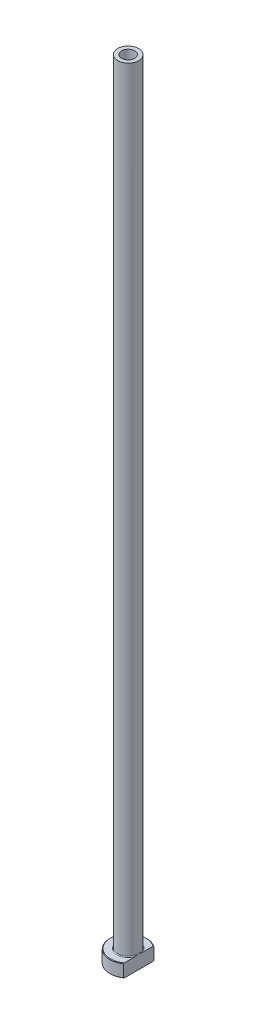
ISO-10303-21;
HEADER;
FILE_DESCRIPTION(('STEP AP214'),'2;1');
FILE_NAME('part.step','',(''),(''),'','','');
FILE_SCHEMA(('AUTOMOTIVE_DESIGN { 1 0 10303 214 1 1 1 1 }'));
ENDSEC;
DATA;
#1=APPLICATION_CONTEXT('core data for automotive mechanical design processes');
#2=APPLICATION_PROTOCOL_DEFINITION('international standard','automotive_design',2000,#1);
#3=PRODUCT_CONTEXT('',#1,'mechanical');
#4=PRODUCT('Part','Part','',(#3));
#5=PRODUCT_RELATED_PRODUCT_CATEGORY('part','',(#4));
#6=PRODUCT_DEFINITION_FORMATION('','',#4);
#7=PRODUCT_DEFINITION_CONTEXT('part definition',#1,'design');
#8=PRODUCT_DEFINITION('design','',#6,#7);
#9=PRODUCT_DEFINITION_SHAPE('','',#8);
#10=(LENGTH_UNIT() NAMED_UNIT(*) SI_UNIT(.MILLI.,.METRE.));
#11=(NAMED_UNIT(*) PLANE_ANGLE_UNIT() SI_UNIT($,.RADIAN.));
#12=(NAMED_UNIT(*) SI_UNIT($,.STERADIAN.) SOLID_ANGLE_UNIT());
#13=UNCERTAINTY_MEASURE_WITH_UNIT(LENGTH_MEASURE(1.E-05),#10,'distance_accuracy_value','');
#14=(GEOMETRIC_REPRESENTATION_CONTEXT(3) GLOBAL_UNCERTAINTY_ASSIGNED_CONTEXT((#13)) GLOBAL_UNIT_ASSIGNED_CONTEXT((#10,
#11,#12)) REPRESENTATION_CONTEXT('',''));
#15=CARTESIAN_POINT('',(0.,0.,0.));
#16=DIRECTION('',(0.,0.,1.));
#17=DIRECTION('',(1.,0.,0.));
#18=AXIS2_PLACEMENT_3D('',#15,#16,#17);
#19=CARTESIAN_POINT('',(0.,92.1876809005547,0.));
#20=DIRECTION('',(0.,1.,0.));
#21=DIRECTION('',(0.,0.,1.));
#22=AXIS2_PLACEMENT_3D('',#19,#20,#21);
#23=CYLINDRICAL_SURFACE('',#22,2.50000000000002);
#24=CARTESIAN_POINT('',(0.,300.,0.));
#25=DIRECTION('',(0.,1.,0.));
#26=DIRECTION('',(0.,0.,1.));
#27=AXIS2_PLACEMENT_3D('',#24,#25,#26);
#28=CIRCLE('',#27,2.50000000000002);
#29=CARTESIAN_POINT('',(0.,300.,2.50000000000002));
#30=VERTEX_POINT('',#29);
#31=EDGE_CURVE('E167',#30,#30,#28,.T.);
#32=ORIENTED_EDGE('',*,*,#31,.T.);
#33=EDGE_LOOP('',(#32));
#34=FACE_BOUND('',#33,.T.);
#35=CARTESIAN_POINT('',(0.,255.,0.));
#36=DIRECTION('',(0.,1.,0.));
#37=DIRECTION('',(0.,0.,1.));
#38=AXIS2_PLACEMENT_3D('',#35,#36,#37);
#39=CIRCLE('',#38,2.50000000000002);
#40=CARTESIAN_POINT('',(0.,255.,2.50000000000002));
#41=VERTEX_POINT('',#40);
#42=EDGE_CURVE('E170',#41,#41,#39,.T.);
#43=ORIENTED_EDGE('',*,*,#42,.F.);
#44=EDGE_LOOP('',(#43));
#45=FACE_BOUND('',#44,.T.);
#46=ADVANCED_FACE('F32',(#34,#45),#23,.F.);
#47=CARTESIAN_POINT('',(-2.50000000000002,300.,0.));
#48=DIRECTION('',(0.,1.,0.));
#49=DIRECTION('',(0.,0.,1.));
#50=AXIS2_PLACEMENT_3D('',#47,#48,#49);
#51=PLANE('',#50);
#52=CARTESIAN_POINT('',(0.,300.,0.));
#53=DIRECTION('',(0.,1.,0.));
#54=DIRECTION('',(0.,0.,1.));
#55=AXIS2_PLACEMENT_3D('',#52,#53,#54);
#56=CIRCLE('',#55,4.00000000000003);
#57=CARTESIAN_POINT('',(0.,300.,4.00000000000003));
#58=VERTEX_POINT('',#57);
#59=EDGE_CURVE('E174',#58,#58,#56,.T.);
#60=ORIENTED_EDGE('',*,*,#59,.T.);
#61=EDGE_LOOP('',(#60));
#62=FACE_BOUND('',#61,.T.);
#63=ORIENTED_EDGE('',*,*,#31,.F.);
#64=EDGE_LOOP('',(#63));
#65=FACE_BOUND('',#64,.T.);
#66=ADVANCED_FACE('F157',(#62,#65),#51,.T.);
#67=CARTESIAN_POINT('',(0.,92.1876809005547,0.));
#68=DIRECTION('',(0.,1.,0.));
#69=DIRECTION('',(0.,0.,1.));
#70=AXIS2_PLACEMENT_3D('',#67,#68,#69);
#71=CYLINDRICAL_SURFACE('',#70,4.00000000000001);
#72=CARTESIAN_POINT('',(0.,5.3,0.));
#73=DIRECTION('',(0.,1.,0.));
#74=DIRECTION('',(0.,0.,1.));
#75=AXIS2_PLACEMENT_3D('',#72,#73,#74);
#76=CIRCLE('',#75,4.00000000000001);
#77=CARTESIAN_POINT('',(4.,5.3,0.));
#78=VERTEX_POINT('',#77);
#79=EDGE_CURVE('E180',#78,#78,#76,.T.);
#80=ORIENTED_EDGE('',*,*,#79,.T.);
#81=EDGE_LOOP('',(#80));
#82=FACE_BOUND('',#81,.T.);
#83=ORIENTED_EDGE('',*,*,#59,.F.);
#84=EDGE_LOOP('',(#83));
#85=FACE_BOUND('',#84,.T.);
#86=ADVANCED_FACE('F162',(#82,#85),#71,.T.);
#87=CARTESIAN_POINT('',(-3.99999999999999,5.,0.));
#88=DIRECTION('',(0.,1.,0.));
#89=DIRECTION('',(0.,0.,1.));
#90=AXIS2_PLACEMENT_3D('',#87,#88,#89);
#91=PLANE('',#90);
#92=DIRECTION('',(0.,0.,1.));
#93=VECTOR('',#92,1.);
#94=CARTESIAN_POINT('',(4.,5.,0.));
#95=LINE('',#94,#93);
#96=CARTESIAN_POINT('',(4.,5.,-5.49909083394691));
#97=VERTEX_POINT('',#96);
#98=CARTESIAN_POINT('',(4.,5.,-1.57797338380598));
#99=VERTEX_POINT('',#98);
#100=EDGE_CURVE('E54',#97,#99,#95,.T.);
#101=ORIENTED_EDGE('',*,*,#100,.F.);
#102=CARTESIAN_POINT('',(0.,5.,0.));
#103=DIRECTION('',(0.,1.,0.));
#104=DIRECTION('',(0.,0.,1.));
#105=AXIS2_PLACEMENT_3D('',#102,#103,#104);
#106=CIRCLE('',#105,6.79999999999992);
#107=CARTESIAN_POINT('',(3.99999999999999,5.,5.49909083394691));
#108=VERTEX_POINT('',#107);
#109=EDGE_CURVE('E186',#97,#108,#106,.T.);
#110=ORIENTED_EDGE('',*,*,#109,.T.);
#111=CARTESIAN_POINT('',(4.,5.,1.57797338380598));
#112=VERTEX_POINT('',#111);
#113=EDGE_CURVE('E134',#112,#108,#95,.T.);
#114=ORIENTED_EDGE('',*,*,#113,.F.);
#115=CARTESIAN_POINT('',(0.,5.,0.));
#116=DIRECTION('',(0.,1.,0.));
#117=DIRECTION('',(0.,0.,1.));
#118=AXIS2_PLACEMENT_3D('',#115,#116,#117);
#119=CIRCLE('',#118,4.30000000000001);
#120=EDGE_CURVE('E183',#112,#99,#119,.F.);
#121=ORIENTED_EDGE('',*,*,#120,.T.);
#122=EDGE_LOOP('',(#101,#110,#114,#121));
#123=FACE_BOUND('',#122,.T.);
#124=ADVANCED_FACE('F197',(#123),#91,.T.);
#125=CARTESIAN_POINT('',(0.,92.1876809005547,0.));
#126=DIRECTION('',(0.,1.,0.));
#127=DIRECTION('',(0.,0.,1.));
#128=AXIS2_PLACEMENT_3D('',#125,#126,#127);
#129=CYLINDRICAL_SURFACE('',#128,6.99999999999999);
#130=DIRECTION('',(0.,-1.,0.));
#131=VECTOR('',#130,1.);
#132=CARTESIAN_POINT('',(3.99999999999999,300.,5.74456264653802));
#133=LINE('',#132,#131);
#134=CARTESIAN_POINT('',(3.99999999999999,4.79999999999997,5.74456264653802));
#135=VERTEX_POINT('',#134);
#136=CARTESIAN_POINT('',(3.99999999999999,0.20000000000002,5.74456264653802));
#137=VERTEX_POINT('',#136);
#138=EDGE_CURVE('E82',#135,#137,#133,.T.);
#139=ORIENTED_EDGE('',*,*,#138,.F.);
#140=CARTESIAN_POINT('',(0.,4.79999999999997,0.));
#141=DIRECTION('',(0.,1.,0.));
#142=DIRECTION('',(0.,0.,1.));
#143=AXIS2_PLACEMENT_3D('',#140,#141,#142);
#144=CIRCLE('',#143,6.99999999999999);
#145=CARTESIAN_POINT('',(4.,4.79999999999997,-5.74456264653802));
#146=VERTEX_POINT('',#145);
#147=EDGE_CURVE('E95',#135,#146,#144,.F.);
#148=ORIENTED_EDGE('',*,*,#147,.T.);
#149=DIRECTION('',(0.,-1.,0.));
#150=VECTOR('',#149,1.);
#151=CARTESIAN_POINT('',(4.,300.,-5.74456264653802));
#152=LINE('',#151,#150);
#153=CARTESIAN_POINT('',(4.,0.20000000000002,-5.74456264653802));
#154=VERTEX_POINT('',#153);
#155=EDGE_CURVE('E192',#146,#154,#152,.T.);
#156=ORIENTED_EDGE('',*,*,#155,.T.);
#157=CARTESIAN_POINT('',(0.,0.20000000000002,0.));
#158=DIRECTION('',(0.,-1.,0.));
#159=DIRECTION('',(0.,0.,-1.));
#160=AXIS2_PLACEMENT_3D('',#157,#158,#159);
#161=CIRCLE('',#160,6.99999999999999);
#162=EDGE_CURVE('E98',#154,#137,#161,.F.);
#163=ORIENTED_EDGE('',*,*,#162,.T.);
#164=EDGE_LOOP('',(#139,#148,#156,#163));
#165=FACE_BOUND('',#164,.T.);
#166=ADVANCED_FACE('F190',(#165),#129,.T.);
#167=CARTESIAN_POINT('',(-6.99999999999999,0.,0.));
#168=DIRECTION('',(0.,-1.,0.));
#169=DIRECTION('',(0.,0.,-1.));
#170=AXIS2_PLACEMENT_3D('',#167,#168,#169);
#171=PLANE('',#170);
#172=CARTESIAN_POINT('',(0.,0.,0.));
#173=DIRECTION('',(0.,-1.,0.));
#174=DIRECTION('',(0.,0.,-1.));
#175=AXIS2_PLACEMENT_3D('',#172,#173,#174);
#176=CIRCLE('',#175,3.24999999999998);
#177=CARTESIAN_POINT('',(0.,0.,-3.24999999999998));
#178=VERTEX_POINT('',#177);
#179=EDGE_CURVE('E40',#178,#178,#176,.F.);
#180=ORIENTED_EDGE('',*,*,#179,.T.);
#181=EDGE_LOOP('',(#180));
#182=FACE_BOUND('',#181,.T.);
#183=DIRECTION('',(0.,0.,-1.));
#184=VECTOR('',#183,1.);
#185=CARTESIAN_POINT('',(3.99999999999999,0.,5.74456264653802));
#186=LINE('',#185,#184);
#187=CARTESIAN_POINT('',(3.99999999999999,0.,5.49909083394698));
#188=VERTEX_POINT('',#187);
#189=CARTESIAN_POINT('',(4.,0.,-5.49909083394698));
#190=VERTEX_POINT('',#189);
#191=EDGE_CURVE('E47',#188,#190,#186,.T.);
#192=ORIENTED_EDGE('',*,*,#191,.F.);
#193=CARTESIAN_POINT('',(0.,0.,0.));
#194=DIRECTION('',(0.,-1.,0.));
#195=DIRECTION('',(0.,0.,-1.));
#196=AXIS2_PLACEMENT_3D('',#193,#194,#195);
#197=CIRCLE('',#196,6.79999999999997);
#198=EDGE_CURVE('E92',#188,#190,#197,.T.);
#199=ORIENTED_EDGE('',*,*,#198,.T.);
#200=EDGE_LOOP('',(#192,#199));
#201=FACE_BOUND('',#200,.T.);
#202=ADVANCED_FACE('F91',(#182,#201),#171,.T.);
#203=CARTESIAN_POINT('',(0.,92.1876809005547,0.));
#204=DIRECTION('',(0.,1.,0.));
#205=DIRECTION('',(0.,0.,1.));
#206=AXIS2_PLACEMENT_3D('',#203,#204,#205);
#207=CYLINDRICAL_SURFACE('',#206,2.75000000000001);
#208=CARTESIAN_POINT('',(0.,0.499999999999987,0.));
#209=DIRECTION('',(0.,-1.,0.));
#210=DIRECTION('',(0.,0.,-1.));
#211=AXIS2_PLACEMENT_3D('',#208,#209,#210);
#212=CIRCLE('',#211,2.75000000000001);
#213=CARTESIAN_POINT('',(0.,0.499999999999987,-2.75000000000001));
#214=VERTEX_POINT('',#213);
#215=EDGE_CURVE('E11',#214,#214,#212,.T.);
#216=ORIENTED_EDGE('',*,*,#215,.T.);
#217=EDGE_LOOP('',(#216));
#218=FACE_BOUND('',#217,.T.);
#219=CARTESIAN_POINT('',(0.,243.,0.));
#220=DIRECTION('',(0.,1.,0.));
#221=DIRECTION('',(0.,0.,1.));
#222=AXIS2_PLACEMENT_3D('',#219,#220,#221);
#223=CIRCLE('',#222,2.75000000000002);
#224=CARTESIAN_POINT('',(0.,243.,2.75000000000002));
#225=VERTEX_POINT('',#224);
#226=EDGE_CURVE('E172',#225,#225,#223,.T.);
#227=ORIENTED_EDGE('',*,*,#226,.T.);
#228=EDGE_LOOP('',(#227));
#229=FACE_BOUND('',#228,.T.);
#230=ADVANCED_FACE('F215',(#218,#229),#207,.F.);
#231=CARTESIAN_POINT('',(0.,243.,0.));
#232=DIRECTION('',(0.,-1.,0.));
#233=DIRECTION('',(0.,0.,-1.));
#234=AXIS2_PLACEMENT_3D('',#231,#232,#233);
#235=CONICAL_SURFACE('',#234,2.75000000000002,0.0208303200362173);
#236=ORIENTED_EDGE('',*,*,#42,.T.);
#237=EDGE_LOOP('',(#236));
#238=FACE_BOUND('',#237,.T.);
#239=ORIENTED_EDGE('',*,*,#226,.F.);
#240=EDGE_LOOP('',(#239));
#241=FACE_BOUND('',#240,.T.);
#242=ADVANCED_FACE('F111',(#238,#241),#235,.F.);
#243=CARTESIAN_POINT('',(0.,5.3,0.));
#244=DIRECTION('',(0.,1.,0.));
#245=DIRECTION('',(0.,0.,1.));
#246=AXIS2_PLACEMENT_3D('',#243,#244,#245);
#247=TOROIDAL_SURFACE('',#246,4.30000000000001,0.3);
#248=ORIENTED_EDGE('',*,*,#120,.F.);
#249=CARTESIAN_POINT('',(4.,5.3,0.));
#250=CARTESIAN_POINT('',(4.,5.30000062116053,-1.06261146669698E-10));
#251=CARTESIAN_POINT('',(4.,5.30000124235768,2.17726199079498E-07));
#252=CARTESIAN_POINT('',(4.,5.30000240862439,8.36141292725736E-07));
#253=CARTESIAN_POINT('',(4.,5.30000294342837,1.25011714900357E-06));
#254=CARTESIAN_POINT('',(4.,5.30000404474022,2.23959386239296E-06));
#255=CARTESIAN_POINT('',(4.,5.30000459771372,2.83084521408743E-06));
#256=CARTESIAN_POINT('',(4.,5.30000559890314,4.06516670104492E-06));
#257=CARTESIAN_POINT('',(4.,5.30000604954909,4.70640147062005E-06));
#258=CARTESIAN_POINT('',(4.,5.30000769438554,7.15677314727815E-06));
#259=CARTESIAN_POINT('',(4.,5.30000879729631,9.02996112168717E-06));
#260=CARTESIAN_POINT('',(4.,5.30001063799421,1.27664902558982E-05));
#261=CARTESIAN_POINT('',(4.,5.30001139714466,1.46197820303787E-05));
#262=CARTESIAN_POINT('',(4.,5.30001453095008,2.23679246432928E-05));
#263=CARTESIAN_POINT('',(4.,5.3000168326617,2.82968783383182E-05));
#264=CARTESIAN_POINT('',(4.,5.30002027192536,3.95668769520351E-05));
#265=CARTESIAN_POINT('',(4.,5.30002152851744,4.48715497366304E-05));
#266=CARTESIAN_POINT('',(4.,5.30003060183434,8.40118257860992E-05));
#267=CARTESIAN_POINT('',(4.,5.3000373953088,0.000118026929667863));
#268=CARTESIAN_POINT('',(4.,5.30006713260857,0.000252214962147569));
#269=CARTESIAN_POINT('',(4.,5.30009559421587,0.000351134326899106));
#270=CARTESIAN_POINT('',(4.,5.30020622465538,0.000742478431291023));
#271=CARTESIAN_POINT('',(4.,5.30028475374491,0.00103561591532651));
#272=CARTESIAN_POINT('',(4.,5.30059889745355,0.00219920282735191));
#273=CARTESIAN_POINT('',(4.,5.30083905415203,0.00306873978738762));
#274=CARTESIAN_POINT('',(4.,5.30183682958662,0.0066914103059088));
#275=CARTESIAN_POINT('',(4.,5.30258877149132,0.00944568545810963));
#276=CARTESIAN_POINT('',(3.99999999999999,5.31066890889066,0.0390293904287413));
#277=CARTESIAN_POINT('',(4.,5.31802631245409,0.0658531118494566));
#278=CARTESIAN_POINT('',(4.,5.33239676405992,0.118441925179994));
#279=CARTESIAN_POINT('',(4.,5.33941183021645,0.144206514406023));
#280=CARTESIAN_POINT('',(4.,5.35427366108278,0.199017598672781));
#281=CARTESIAN_POINT('',(4.,5.36211313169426,0.228066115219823));
#282=CARTESIAN_POINT('',(4.,5.37776349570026,0.28651184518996));
#283=CARTESIAN_POINT('',(4.,5.38557313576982,0.315909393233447));
#284=CARTESIAN_POINT('',(4.,5.404256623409,0.386994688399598));
#285=CARTESIAN_POINT('',(4.,5.41505237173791,0.428703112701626));
#286=CARTESIAN_POINT('',(4.,5.4359231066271,0.511098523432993));
#287=CARTESIAN_POINT('',(4.,5.44600969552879,0.551782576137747));
#288=CARTESIAN_POINT('',(4.,5.47850986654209,0.686599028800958));
#289=CARTESIAN_POINT('',(4.,5.49978370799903,0.781011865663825));
#290=CARTESIAN_POINT('',(4.,5.53807543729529,0.971847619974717));
#291=CARTESIAN_POINT('',(4.,5.55504273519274,1.06828120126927));
#292=CARTESIAN_POINT('',(4.,5.57582405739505,1.21752725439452));
#293=CARTESIAN_POINT('',(4.,5.58209796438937,1.26999379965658));
#294=CARTESIAN_POINT('',(4.,5.59210686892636,1.37516324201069));
#295=CARTESIAN_POINT('',(4.,5.59584265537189,1.42786606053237));
#296=CARTESIAN_POINT('',(4.,5.60010438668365,1.53310673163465));
#297=CARTESIAN_POINT('',(4.,5.6006487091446,1.58564378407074));
#298=CARTESIAN_POINT('',(4.,5.59767158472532,1.69058605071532));
#299=CARTESIAN_POINT('',(4.,5.59415502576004,1.74299134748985));
#300=CARTESIAN_POINT('',(4.,5.58503062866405,1.81903290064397));
#301=CARTESIAN_POINT('',(4.,5.58157617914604,1.84292934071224));
#302=CARTESIAN_POINT('',(4.,5.57329952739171,1.89051061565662));
#303=CARTESIAN_POINT('',(4.,5.56847619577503,1.91419525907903));
#304=CARTESIAN_POINT('',(4.,5.55726644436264,1.96092888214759));
#305=CARTESIAN_POINT('',(4.,5.55089740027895,1.9839819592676));
#306=CARTESIAN_POINT('',(4.,5.53623434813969,2.02945550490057));
#307=CARTESIAN_POINT('',(4.,5.52794253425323,2.0518766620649));
#308=CARTESIAN_POINT('',(4.,5.50887098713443,2.09590631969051));
#309=CARTESIAN_POINT('',(4.,5.49806837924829,2.11750508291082));
#310=CARTESIAN_POINT('',(4.,5.47333401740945,2.15885583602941));
#311=CARTESIAN_POINT('',(4.,5.45941272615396,2.1786136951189));
#312=CARTESIAN_POINT('',(4.,5.4358822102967,2.20522942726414));
#313=CARTESIAN_POINT('',(4.,5.42781139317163,2.2134404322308));
#314=CARTESIAN_POINT('',(4.,5.41065114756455,2.228751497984));
#315=CARTESIAN_POINT('',(4.,5.40156129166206,2.23585108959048));
#316=CARTESIAN_POINT('',(4.,5.38220524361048,2.24859694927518));
#317=CARTESIAN_POINT('',(4.,5.37192420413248,2.25422119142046));
#318=CARTESIAN_POINT('',(4.,5.35045072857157,2.26331064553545));
#319=CARTESIAN_POINT('',(4.,5.33926122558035,2.26678251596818));
#320=CARTESIAN_POINT('',(4.,5.31952044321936,2.27051268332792));
#321=CARTESIAN_POINT('',(4.,5.31108453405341,2.27139016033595));
#322=CARTESIAN_POINT('',(4.,5.29418624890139,2.27168963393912));
#323=CARTESIAN_POINT('',(4.,5.28572387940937,2.27111196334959));
#324=CARTESIAN_POINT('',(4.,5.26904138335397,2.26855580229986));
#325=CARTESIAN_POINT('',(4.,5.26082066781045,2.26658107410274));
#326=CARTESIAN_POINT('',(4.,5.24478214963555,2.26139496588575));
#327=CARTESIAN_POINT('',(4.,5.23696461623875,2.25818277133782));
#328=CARTESIAN_POINT('',(4.,5.21851235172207,2.24908332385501));
#329=CARTESIAN_POINT('',(4.,5.2081521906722,2.24264095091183));
#330=CARTESIAN_POINT('',(4.,5.18857975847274,2.22819957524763));
#331=CARTESIAN_POINT('',(4.,5.17937061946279,2.22019647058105));
#332=CARTESIAN_POINT('',(4.,5.15665383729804,2.19777756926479));
#333=CARTESIAN_POINT('',(4.,5.14403484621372,2.18246908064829));
#334=CARTESIAN_POINT('',(4.,5.12118369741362,2.15020843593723));
#335=CARTESIAN_POINT('',(4.,5.11095480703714,2.13325407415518));
#336=CARTESIAN_POINT('',(4.,5.09273574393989,2.09892324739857));
#337=CARTESIAN_POINT('',(4.,5.08468212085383,2.08157988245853));
#338=CARTESIAN_POINT('',(4.,5.07005901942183,2.04627072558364));
#339=CARTESIAN_POINT('',(4.,5.06349101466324,2.02830433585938));
#340=CARTESIAN_POINT('',(4.,5.0455548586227,1.97350761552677));
#341=CARTESIAN_POINT('',(4.,5.03608974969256,1.93605770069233));
#342=CARTESIAN_POINT('',(4.,5.01780569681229,1.84529235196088));
#343=CARTESIAN_POINT('',(4.,5.01077018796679,1.79164082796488));
#344=CARTESIAN_POINT('',(4.,5.00182846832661,1.68379947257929));
#345=CARTESIAN_POINT('',(4.,4.99993887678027,1.62960846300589));
#346=CARTESIAN_POINT('',(4.,5.00006129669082,1.5236120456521));
#347=CARTESIAN_POINT('',(4.,5.00190698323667,1.47180551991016));
#348=CARTESIAN_POINT('',(4.,5.00841243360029,1.36835357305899));
#349=CARTESIAN_POINT('',(4.,5.01307376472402,1.316708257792));
#350=CARTESIAN_POINT('',(4.,5.0290548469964,1.17431887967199));
#351=CARTESIAN_POINT('',(4.,5.04274090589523,1.08384207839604));
#352=CARTESIAN_POINT('',(4.,5.0670171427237,0.947757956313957));
#353=CARTESIAN_POINT('',(4.,5.07585573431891,0.90181406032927));
#354=CARTESIAN_POINT('',(4.,5.09458665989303,0.810008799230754));
#355=CARTESIAN_POINT('',(4.,5.10448180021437,0.764148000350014));
#356=CARTESIAN_POINT('',(4.,5.1289243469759,0.655631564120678));
#357=CARTESIAN_POINT('',(4.,5.14383556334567,0.593058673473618));
#358=CARTESIAN_POINT('',(4.,5.17458762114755,0.468885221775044));
#359=CARTESIAN_POINT('',(4.,5.19041623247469,0.407281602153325));
#360=CARTESIAN_POINT('',(4.,5.22090834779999,0.291232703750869));
#361=CARTESIAN_POINT('',(4.,5.23550024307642,0.236768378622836));
#362=CARTESIAN_POINT('',(3.99999999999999,5.26562550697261,0.125604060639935));
#363=CARTESIAN_POINT('',(3.99999999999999,5.28117250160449,0.068907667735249));
#364=CARTESIAN_POINT('',(4.,5.29741226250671,0.00944154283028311));
#365=CARTESIAN_POINT('',(4.,5.29816540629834,0.00668315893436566));
#366=CARTESIAN_POINT('',(4.,5.29916346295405,0.00305954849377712));
#367=CARTESIAN_POINT('',(4.,5.29940273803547,0.00219318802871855));
#368=CARTESIAN_POINT('',(4.,5.29971580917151,0.00103357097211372));
#369=CARTESIAN_POINT('',(4.,5.29979412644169,0.000741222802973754));
#370=CARTESIAN_POINT('',(4.,5.29990450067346,0.000350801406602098));
#371=CARTESIAN_POINT('',(4.,5.29993292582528,0.000252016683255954));
#372=CARTESIAN_POINT('',(4.,5.29996263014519,0.000117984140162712));
#373=CARTESIAN_POINT('',(4.,5.299969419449,8.39881949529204E-05));
#374=CARTESIAN_POINT('',(4.,5.29997848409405,4.48674047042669E-05));
#375=CARTESIAN_POINT('',(4.,5.29997973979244,3.95638224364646E-05));
#376=CARTESIAN_POINT('',(4.,5.29998317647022,2.82960367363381E-05));
#377=CARTESIAN_POINT('',(4.,5.29998547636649,2.23681476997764E-05));
#378=CARTESIAN_POINT('',(4.,5.29998860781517,1.46211013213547E-05));
#379=CARTESIAN_POINT('',(4.,5.29998936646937,1.27678912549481E-05));
#380=CARTESIAN_POINT('',(4.,5.29999120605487,9.03144163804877E-06));
#381=CARTESIAN_POINT('',(4.,5.29999230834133,7.15824173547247E-06));
#382=CARTESIAN_POINT('',(4.,5.29999395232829,4.70775574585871E-06));
#383=CARTESIAN_POINT('',(4.,5.29999440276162,4.06646440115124E-06));
#384=CARTESIAN_POINT('',(4.,5.2999954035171,2.83199139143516E-06));
#385=CARTESIAN_POINT('',(4.,5.299995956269,2.24064386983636E-06));
#386=CARTESIAN_POINT('',(4.,5.29999705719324,1.25094003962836E-06));
#387=CARTESIAN_POINT('',(4.,5.29999759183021,8.36841346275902E-07));
#388=CARTESIAN_POINT('',(4.,5.29999875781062,2.18117879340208E-07));
#389=CARTESIAN_POINT('',(4.,5.299999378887,1.0625422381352E-10));
#390=CARTESIAN_POINT('',(4.,5.3,0.));
#391=B_SPLINE_CURVE_WITH_KNOTS('',3,(#249,#250,#251,#252,#253,#254,#255,#256,#257,#258,#259,
#260,#261,#262,#263,#264,#265,#266,#267,#268,#269,#270,#271,#272,#273,#274,#275,#276,#277,#278,
#279,#280,#281,#282,#283,#284,#285,#286,#287,#288,#289,#290,#291,#292,#293,#294,#295,#296,#297,
#298,#299,#300,#301,#302,#303,#304,#305,#306,#307,#308,#309,#310,#311,#312,#313,#314,#315,#316,
#317,#318,#319,#320,#321,#322,#323,#324,#325,#326,#327,#328,#329,#330,#331,#332,#333,#334,#335,
#336,#337,#338,#339,#340,#341,#342,#343,#344,#345,#346,#347,#348,#349,#350,#351,#352,#353,#354,
#355,#356,#357,#358,#359,#360,#361,#362,#363,#364,#365,#366,#367,#368,#369,#370,#371,#372,#373,
#374,#375,#376,#377,#378,#379,#380,#381,#382,#383,#384,#385,#386,#387,#388,#389,#390),
.UNSPECIFIED.,.T.,.F.,(4,2,2,2,2,2,2,2,2,2,2,2,2,2,2,2,2,2,2,2,2,2,2,2,2,2,2,2,2,2,2,2,2,2,2,2,
2,2,2,2,2,2,2,2,2,2,2,2,2,2,2,2,2,2,2,2,2,2,2,2,2,2,2,2,2,2,2,2,2,2,4),(0.,1.87484270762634E-06,
3.90179765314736E-06,6.31683512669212E-06,8.66651565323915E-06,1.51627509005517E-05,
2.11657875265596E-05,4.02090722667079E-05,5.65429401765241E-05,0.0001606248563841,
0.000469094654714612,0.00137985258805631,0.00408571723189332,0.0126514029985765,
0.0960918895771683,0.176200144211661,0.266463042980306,0.357714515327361,0.48696124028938,
0.612707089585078,0.902988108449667,1.19653589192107,1.35501075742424,1.51343634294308,
1.67094875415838,1.82827177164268,1.90067591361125,1.97313996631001,2.04482437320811,
2.11642737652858,2.18871023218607,2.26075412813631,2.29521947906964,2.32969934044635,
2.36466792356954,2.39952778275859,2.42485422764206,2.45017488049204,2.47542760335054,
2.50069697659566,2.53708899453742,2.57357798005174,2.63276032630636,2.69202310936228,
2.74930315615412,2.80663977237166,2.92223125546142,3.08420752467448,3.24670629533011,
3.40212850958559,3.55763731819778,3.83192962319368,3.97228382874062,4.11302057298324,
4.30598130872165,4.49678885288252,4.6659444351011,4.84230602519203,4.85088453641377,
4.85358051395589,4.85448881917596,4.8547968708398,4.8549008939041,4.8549172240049,
4.85493626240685,4.85494226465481,4.85494875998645,4.85495110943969,4.85495352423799,
4.85495555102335,4.8549574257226),.UNSPECIFIED.);
#392=EDGE_CURVE('E126',#112,#78,#391,.T.);
#393=ORIENTED_EDGE('',*,*,#392,.T.);
#394=ORIENTED_EDGE('',*,*,#79,.F.);
#395=CARTESIAN_POINT('',(4.,5.3,0.));
#396=CARTESIAN_POINT('',(4.,5.29999937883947,1.0626241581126E-10));
#397=CARTESIAN_POINT('',(4.,5.29999875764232,-2.17726197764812E-07));
#398=CARTESIAN_POINT('',(4.,5.2999975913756,-8.36141291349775E-07));
#399=CARTESIAN_POINT('',(4.,5.29999705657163,-1.2501171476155E-06));
#400=CARTESIAN_POINT('',(4.,5.29999595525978,-2.23959386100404E-06));
#401=CARTESIAN_POINT('',(4.,5.29999540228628,-2.83084521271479E-06));
#402=CARTESIAN_POINT('',(4.,5.29999440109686,-4.06516669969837E-06));
#403=CARTESIAN_POINT('',(4.,5.29999395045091,-4.7064014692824E-06));
#404=CARTESIAN_POINT('',(4.,5.29999230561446,-7.15677314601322E-06));
#405=CARTESIAN_POINT('',(4.,5.29999120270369,-9.02996112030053E-06));
#406=CARTESIAN_POINT('',(4.,5.29998936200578,-1.27664902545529E-05));
#407=CARTESIAN_POINT('',(4.,5.29998860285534,-1.46197820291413E-05));
#408=CARTESIAN_POINT('',(4.,5.29998546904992,-2.23679246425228E-05));
#409=CARTESIAN_POINT('',(4.,5.2999831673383,-2.8296878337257E-05));
#410=CARTESIAN_POINT('',(4.,5.29997972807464,-3.95668769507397E-05));
#411=CARTESIAN_POINT('',(4.,5.29997847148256,-4.48715497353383E-05));
#412=CARTESIAN_POINT('',(4.,5.29996939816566,-8.40118257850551E-05));
#413=CARTESIAN_POINT('',(4.,5.2999626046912,-0.000118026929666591));
#414=CARTESIAN_POINT('',(4.,5.29993286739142,-0.000252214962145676));
#415=CARTESIAN_POINT('',(4.,5.29990440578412,-0.000351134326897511));
#416=CARTESIAN_POINT('',(4.,5.29979377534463,-0.000742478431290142));
#417=CARTESIAN_POINT('',(4.,5.29971524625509,-0.00103561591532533));
#418=CARTESIAN_POINT('',(4.,5.29940110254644,-0.00219920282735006));
#419=CARTESIAN_POINT('',(4.,5.29916094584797,-0.00306873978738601));
#420=CARTESIAN_POINT('',(4.,5.29816317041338,-0.00669141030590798));
#421=CARTESIAN_POINT('',(4.,5.29741122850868,-0.00944568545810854));
#422=CARTESIAN_POINT('',(3.99999999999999,5.28933109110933,-0.0390293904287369));
#423=CARTESIAN_POINT('',(4.,5.2819736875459,-0.065853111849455));
#424=CARTESIAN_POINT('',(4.,5.26760323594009,-0.118441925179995));
#425=CARTESIAN_POINT('',(4.,5.26058816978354,-0.144206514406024));
#426=CARTESIAN_POINT('',(4.,5.24572633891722,-0.199017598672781));
#427=CARTESIAN_POINT('',(4.,5.23788686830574,-0.228066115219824));
#428=CARTESIAN_POINT('',(4.,5.22223650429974,-0.28651184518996));
#429=CARTESIAN_POINT('',(4.,5.21442686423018,-0.315909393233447));
#430=CARTESIAN_POINT('',(4.,5.195743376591,-0.386994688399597));
#431=CARTESIAN_POINT('',(4.,5.18494762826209,-0.428703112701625));
#432=CARTESIAN_POINT('',(4.,5.1640768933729,-0.511098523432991));
#433=CARTESIAN_POINT('',(4.,5.1539903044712,-0.551782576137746));
#434=CARTESIAN_POINT('',(4.,5.12149013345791,-0.686599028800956));
#435=CARTESIAN_POINT('',(4.,5.10021629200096,-0.781011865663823));
#436=CARTESIAN_POINT('',(4.,5.06192456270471,-0.971847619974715));
#437=CARTESIAN_POINT('',(4.,5.04495726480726,-1.06828120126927));
#438=CARTESIAN_POINT('',(4.,5.02417594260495,-1.21752725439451));
#439=CARTESIAN_POINT('',(4.,5.01790203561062,-1.26999379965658));
#440=CARTESIAN_POINT('',(4.,5.00789313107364,-1.37516324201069));
#441=CARTESIAN_POINT('',(4.,5.00415734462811,-1.42786606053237));
#442=CARTESIAN_POINT('',(4.,4.99989561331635,-1.53310673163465));
#443=CARTESIAN_POINT('',(4.,4.9993512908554,-1.58564378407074));
#444=CARTESIAN_POINT('',(4.,5.00232841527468,-1.69058605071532));
#445=CARTESIAN_POINT('',(4.,5.00584497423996,-1.74299134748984));
#446=CARTESIAN_POINT('',(4.,5.01496937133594,-1.81903290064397));
#447=CARTESIAN_POINT('',(4.,5.01842382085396,-1.84292934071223));
#448=CARTESIAN_POINT('',(4.,5.02670047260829,-1.89051061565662));
#449=CARTESIAN_POINT('',(4.,5.03152380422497,-1.91419525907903));
#450=CARTESIAN_POINT('',(4.,5.04273355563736,-1.96092888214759));
#451=CARTESIAN_POINT('',(4.,5.04910259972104,-1.9839819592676));
#452=CARTESIAN_POINT('',(4.,5.06376565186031,-2.02945550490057));
#453=CARTESIAN_POINT('',(4.,5.07205746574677,-2.0518766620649));
#454=CARTESIAN_POINT('',(4.,5.09112901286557,-2.0959063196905));
#455=CARTESIAN_POINT('',(4.,5.10193162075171,-2.11750508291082));
#456=CARTESIAN_POINT('',(4.,5.12666598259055,-2.15885583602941));
#457=CARTESIAN_POINT('',(4.,5.14058727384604,-2.17861369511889));
#458=CARTESIAN_POINT('',(4.,5.1641177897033,-2.20522942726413));
#459=CARTESIAN_POINT('',(4.,5.17218860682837,-2.2134404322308));
#460=CARTESIAN_POINT('',(4.,5.18934885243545,-2.22875149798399));
#461=CARTESIAN_POINT('',(4.,5.19843870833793,-2.23585108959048));
#462=CARTESIAN_POINT('',(4.,5.21779475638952,-2.24859694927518));
#463=CARTESIAN_POINT('',(4.,5.22807579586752,-2.25422119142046));
#464=CARTESIAN_POINT('',(4.,5.24954927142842,-2.26331064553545));
#465=CARTESIAN_POINT('',(4.,5.26073877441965,-2.26678251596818));
#466=CARTESIAN_POINT('',(4.,5.28047955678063,-2.27051268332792));
#467=CARTESIAN_POINT('',(4.,5.28891546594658,-2.27139016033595));
#468=CARTESIAN_POINT('',(4.,5.3058137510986,-2.27168963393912));
#469=CARTESIAN_POINT('',(4.,5.31427612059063,-2.27111196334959));
#470=CARTESIAN_POINT('',(4.,5.33095861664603,-2.26855580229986));
#471=CARTESIAN_POINT('',(4.,5.33917933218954,-2.26658107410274));
#472=CARTESIAN_POINT('',(4.,5.35521785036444,-2.26139496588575));
#473=CARTESIAN_POINT('',(4.,5.36303538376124,-2.25818277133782));
#474=CARTESIAN_POINT('',(4.,5.38148764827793,-2.24908332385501));
#475=CARTESIAN_POINT('',(4.,5.3918478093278,-2.24264095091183));
#476=CARTESIAN_POINT('',(4.,5.41142024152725,-2.22819957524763));
#477=CARTESIAN_POINT('',(4.,5.4206293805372,-2.22019647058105));
#478=CARTESIAN_POINT('',(4.,5.44334616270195,-2.19777756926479));
#479=CARTESIAN_POINT('',(4.,5.45596515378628,-2.18246908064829));
#480=CARTESIAN_POINT('',(4.,5.47881630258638,-2.15020843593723));
#481=CARTESIAN_POINT('',(4.,5.48904519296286,-2.13325407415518));
#482=CARTESIAN_POINT('',(4.,5.50726425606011,-2.09892324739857));
#483=CARTESIAN_POINT('',(4.,5.51531787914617,-2.08157988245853));
#484=CARTESIAN_POINT('',(4.,5.52994098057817,-2.04627072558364));
#485=CARTESIAN_POINT('',(4.,5.53650898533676,-2.02830433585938));
#486=CARTESIAN_POINT('',(4.,5.5544451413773,-1.97350761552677));
#487=CARTESIAN_POINT('',(4.,5.56391025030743,-1.93605770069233));
#488=CARTESIAN_POINT('',(4.,5.5821943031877,-1.84529235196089));
#489=CARTESIAN_POINT('',(4.,5.58922981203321,-1.79164082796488));
#490=CARTESIAN_POINT('',(4.,5.59817153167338,-1.68379947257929));
#491=CARTESIAN_POINT('',(4.,5.60006112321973,-1.62960846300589));
#492=CARTESIAN_POINT('',(4.,5.59993870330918,-1.5236120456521));
#493=CARTESIAN_POINT('',(4.,5.59809301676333,-1.47180551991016));
#494=CARTESIAN_POINT('',(4.,5.59158756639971,-1.36835357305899));
#495=CARTESIAN_POINT('',(4.,5.58692623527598,-1.316708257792));
#496=CARTESIAN_POINT('',(4.,5.5709451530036,-1.17431887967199));
#497=CARTESIAN_POINT('',(4.,5.55725909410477,-1.08384207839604));
#498=CARTESIAN_POINT('',(4.,5.53298285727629,-0.947757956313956));
#499=CARTESIAN_POINT('',(4.,5.52414426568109,-0.901814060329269));
#500=CARTESIAN_POINT('',(4.,5.50541334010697,-0.810008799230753));
#501=CARTESIAN_POINT('',(4.,5.49551819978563,-0.764148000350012));
#502=CARTESIAN_POINT('',(4.,5.4710756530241,-0.655631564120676));
#503=CARTESIAN_POINT('',(4.,5.45616443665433,-0.593058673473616));
#504=CARTESIAN_POINT('',(4.,5.42541237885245,-0.468885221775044));
#505=CARTESIAN_POINT('',(4.,5.4095837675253,-0.407281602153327));
#506=CARTESIAN_POINT('',(4.,5.37909165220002,-0.291232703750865));
#507=CARTESIAN_POINT('',(4.,5.36449975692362,-0.236768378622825));
#508=CARTESIAN_POINT('',(3.99999999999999,5.33437449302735,-0.125604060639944));
#509=CARTESIAN_POINT('',(3.99999999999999,5.31882749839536,-0.0689076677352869));
#510=CARTESIAN_POINT('',(4.,5.30258773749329,-0.00944154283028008));
#511=CARTESIAN_POINT('',(4.,5.30183459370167,-0.00668315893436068));
#512=CARTESIAN_POINT('',(4.,5.30083653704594,-0.00305954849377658));
#513=CARTESIAN_POINT('',(4.,5.30059726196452,-0.00219318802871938));
#514=CARTESIAN_POINT('',(4.,5.30028419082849,-0.00103357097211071));
#515=CARTESIAN_POINT('',(4.,5.30020587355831,-0.000741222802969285));
#516=CARTESIAN_POINT('',(4.,5.30009549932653,-0.000350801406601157));
#517=CARTESIAN_POINT('',(4.,5.30006707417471,-0.000252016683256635));
#518=CARTESIAN_POINT('',(4.,5.30003736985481,-0.000117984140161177));
#519=CARTESIAN_POINT('',(4.,5.30003058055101,-8.39881949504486E-05));
#520=CARTESIAN_POINT('',(4.,5.30002151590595,-4.48674047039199E-05));
#521=CARTESIAN_POINT('',(4.,5.30002026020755,-3.95638224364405E-05));
#522=CARTESIAN_POINT('',(4.,5.30001682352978,-2.8296036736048E-05));
#523=CARTESIAN_POINT('',(4.,5.30001452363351,-2.23681476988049E-05));
#524=CARTESIAN_POINT('',(4.,5.30001139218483,-1.46211013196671E-05));
#525=CARTESIAN_POINT('',(4.,5.30001063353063,-1.27678912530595E-05));
#526=CARTESIAN_POINT('',(4.,5.30000879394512,-9.03144163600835E-06));
#527=CARTESIAN_POINT('',(4.,5.30000769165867,-7.15824173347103E-06));
#528=CARTESIAN_POINT('',(4.,5.30000604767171,-4.70775574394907E-06));
#529=CARTESIAN_POINT('',(4.,5.30000559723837,-4.06646439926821E-06));
#530=CARTESIAN_POINT('',(4.,5.3000045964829,-2.83199138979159E-06));
#531=CARTESIAN_POINT('',(4.,5.300004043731,-2.2406438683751E-06));
#532=CARTESIAN_POINT('',(4.,5.30000294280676,-1.25094003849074E-06));
#533=CARTESIAN_POINT('',(4.,5.30000240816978,-8.36841345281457E-07));
#534=CARTESIAN_POINT('',(4.,5.30000124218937,-2.18117878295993E-07));
#535=CARTESIAN_POINT('',(4.,5.300000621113,-1.06253077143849E-10));
#536=CARTESIAN_POINT('',(4.,5.3,0.));
#537=B_SPLINE_CURVE_WITH_KNOTS('',3,(#395,#396,#397,#398,#399,#400,#401,#402,#403,#404,#405,
#406,#407,#408,#409,#410,#411,#412,#413,#414,#415,#416,#417,#418,#419,#420,#421,#422,#423,#424,
#425,#426,#427,#428,#429,#430,#431,#432,#433,#434,#435,#436,#437,#438,#439,#440,#441,#442,#443,
#444,#445,#446,#447,#448,#449,#450,#451,#452,#453,#454,#455,#456,#457,#458,#459,#460,#461,#462,
#463,#464,#465,#466,#467,#468,#469,#470,#471,#472,#473,#474,#475,#476,#477,#478,#479,#480,#481,
#482,#483,#484,#485,#486,#487,#488,#489,#490,#491,#492,#493,#494,#495,#496,#497,#498,#499,#500,
#501,#502,#503,#504,#505,#506,#507,#508,#509,#510,#511,#512,#513,#514,#515,#516,#517,#518,#519,
#520,#521,#522,#523,#524,#525,#526,#527,#528,#529,#530,#531,#532,#533,#534,#535,#536),
.UNSPECIFIED.,.T.,.F.,(4,2,2,2,2,2,2,2,2,2,2,2,2,2,2,2,2,2,2,2,2,2,2,2,2,2,2,2,2,2,2,2,2,2,2,2,
2,2,2,2,2,2,2,2,2,2,2,2,2,2,2,2,2,2,2,2,2,2,2,2,2,2,2,2,2,2,2,2,2,2,4),(0.,1.87484270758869E-06,
3.90179765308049E-06,6.31683512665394E-06,8.66651565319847E-06,1.51627509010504E-05,
2.11657875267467E-05,4.02090722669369E-05,5.65429401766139E-05,0.000160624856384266,
0.000469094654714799,0.00137985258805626,0.00408571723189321,0.0126514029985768,
0.0960918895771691,0.176200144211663,0.266463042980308,0.357714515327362,0.48696124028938,
0.612707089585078,0.902988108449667,1.19653589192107,1.35501075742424,1.51343634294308,
1.67094875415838,1.82827177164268,1.90067591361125,1.97313996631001,2.04482437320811,
2.11642737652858,2.18871023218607,2.26075412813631,2.29521947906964,2.32969934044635,
2.36466792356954,2.39952778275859,2.42485422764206,2.45017488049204,2.47542760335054,
2.50069697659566,2.53708899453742,2.57357798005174,2.63276032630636,2.69202310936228,
2.74930315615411,2.80663977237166,2.92223125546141,3.08420752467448,3.24670629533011,
3.40212850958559,3.55763731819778,3.83192962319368,3.97228382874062,4.11302057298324,
4.30598130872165,4.49678885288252,4.6659444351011,4.84230602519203,4.85088453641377,
4.85358051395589,4.85448881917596,4.8547968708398,4.8549008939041,4.85491722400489,
4.85493626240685,4.85494226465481,4.85494875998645,4.85495110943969,4.85495352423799,
4.85495555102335,4.8549574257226),.UNSPECIFIED.);
#538=EDGE_CURVE('E135',#78,#99,#537,.T.);
#539=ORIENTED_EDGE('',*,*,#538,.T.);
#540=EDGE_LOOP('',(#248,#393,#394,#539));
#541=FACE_BOUND('',#540,.T.);
#542=ADVANCED_FACE('F141',(#541),#247,.F.);
#543=CARTESIAN_POINT('',(0.,5.,0.));
#544=DIRECTION('',(0.,-1.,0.));
#545=DIRECTION('',(0.,0.,-1.));
#546=AXIS2_PLACEMENT_3D('',#543,#544,#545);
#547=CONICAL_SURFACE('',#546,6.79999999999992,0.785398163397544);
#548=CARTESIAN_POINT('',(4.,-1.45712845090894,-12.6392822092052));
#549=CARTESIAN_POINT('',(4.,-1.24364466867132,-12.4153556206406));
#550=CARTESIAN_POINT('',(4.,-1.03042430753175,-12.1911774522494));
#551=CARTESIAN_POINT('',(4.,-0.604617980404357,-11.7422167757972));
#552=CARTESIAN_POINT('',(4.,-0.392032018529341,-11.5174342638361));
#553=CARTESIAN_POINT('',(4.,0.0324624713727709,-11.0670952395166));
#554=CARTESIAN_POINT('',(4.,0.244370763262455,-10.8415385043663));
#555=CARTESIAN_POINT('',(4.,0.667290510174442,-10.3895875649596));
#556=CARTESIAN_POINT('',(4.,0.878301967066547,-10.1631933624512));
#557=CARTESIAN_POINT('',(4.,1.51385375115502,-9.47810122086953));
#558=CARTESIAN_POINT('',(4.,1.93676291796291,-9.017882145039));
#559=CARTESIAN_POINT('',(4.,2.56612335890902,-8.32309905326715));
#560=CARTESIAN_POINT('',(4.,2.77505666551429,-8.09078457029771));
#561=CARTESIAN_POINT('',(4.,3.19080254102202,-7.62426940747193));
#562=CARTESIAN_POINT('',(4.,3.3976151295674,-7.39006874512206));
#563=CARTESIAN_POINT('',(4.,3.87870763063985,-6.83891844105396));
#564=CARTESIAN_POINT('',(4.,4.15190978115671,-6.52102188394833));
#565=CARTESIAN_POINT('',(4.,4.55642425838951,-6.03960901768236));
#566=CARTESIAN_POINT('',(4.,4.6904105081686,-5.8783399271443));
#567=CARTESIAN_POINT('',(4.,4.95616531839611,-5.55398469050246));
#568=CARTESIAN_POINT('',(4.,5.08793391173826,-5.39089857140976));
#569=CARTESIAN_POINT('',(4.,5.34841712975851,-5.06288801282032));
#570=CARTESIAN_POINT('',(4.,5.47713786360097,-4.89796843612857));
#571=CARTESIAN_POINT('',(4.,5.73107494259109,-4.56545535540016));
#572=CARTESIAN_POINT('',(4.,5.85629144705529,-4.39786197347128));
#573=CARTESIAN_POINT('',(4.,6.10211465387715,-4.05948444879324));
#574=CARTESIAN_POINT('',(4.,6.22272435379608,-3.88870249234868));
#575=CARTESIAN_POINT('',(4.,6.45796076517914,-3.54308312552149));
#576=CARTESIAN_POINT('',(4.,6.57258867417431,-3.36824653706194));
#577=CARTESIAN_POINT('',(4.,6.76866603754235,-3.05381396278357));
#578=CARTESIAN_POINT('',(4.,6.85173773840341,-2.91523359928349));
#579=CARTESIAN_POINT('',(4.,7.01174537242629,-2.63451965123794));
#580=CARTESIAN_POINT('',(4.,7.08868042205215,-2.49238555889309));
#581=CARTESIAN_POINT('',(4.,7.23459437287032,-2.20416961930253));
#582=CARTESIAN_POINT('',(4.,7.30357836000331,-2.05809037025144));
#583=CARTESIAN_POINT('',(4.,7.43135520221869,-1.76151732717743));
#584=CARTESIAN_POINT('',(4.,7.4901511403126,-1.61102488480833));
#585=CARTESIAN_POINT('',(4.,7.58249315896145,-1.34142099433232));
#586=CARTESIAN_POINT('',(4.,7.61872660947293,-1.22323501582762));
#587=CARTESIAN_POINT('',(4.,7.68223354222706,-0.984492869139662));
#588=CARTESIAN_POINT('',(4.,7.70951040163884,-0.86393761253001));
#589=CARTESIAN_POINT('',(4.,7.75377914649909,-0.621342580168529));
#590=CARTESIAN_POINT('',(4.,7.77080509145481,-0.499309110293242));
#591=CARTESIAN_POINT('',(4.,7.79378778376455,-0.25419448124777));
#592=CARTESIAN_POINT('',(4.,7.79974523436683,-0.13111338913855));
#593=CARTESIAN_POINT('',(4.,7.8002395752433,0.11551726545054));
#594=CARTESIAN_POINT('',(4.,7.79473514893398,0.239066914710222));
#595=CARTESIAN_POINT('',(4.,7.77255119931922,0.485148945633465));
#596=CARTESIAN_POINT('',(4.,7.75587091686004,0.607681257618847));
#597=CARTESIAN_POINT('',(4.,7.71218353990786,0.851269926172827));
#598=CARTESIAN_POINT('',(4.,7.6851436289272,0.972320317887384));
#599=CARTESIAN_POINT('',(4.,7.62201202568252,1.21200276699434));
#600=CARTESIAN_POINT('',(4.,7.58591962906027,1.33063463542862));
#601=CARTESIAN_POINT('',(4.,7.4598007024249,1.70122439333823));
#602=CARTESIAN_POINT('',(4.,7.35572950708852,1.94843335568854));
#603=CARTESIAN_POINT('',(4.,7.18186715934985,2.31048534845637));
#604=CARTESIAN_POINT('',(4.,7.12087684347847,2.4298356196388));
#605=CARTESIAN_POINT('',(4.,6.99403531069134,2.6659362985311));
#606=CARTESIAN_POINT('',(3.99999999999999,6.92818466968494,2.78268701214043));
#607=CARTESIAN_POINT('',(3.99999999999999,6.79157875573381,3.01550895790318));
#608=CARTESIAN_POINT('',(3.99999999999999,6.72076681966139,3.13154660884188));
#609=CARTESIAN_POINT('',(3.99999999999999,6.57583116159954,3.36153379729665));
#610=CARTESIAN_POINT('',(3.99999999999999,6.50170736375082,3.47548328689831));
#611=CARTESIAN_POINT('',(3.99999999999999,6.35080982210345,3.70145107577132));
#612=CARTESIAN_POINT('',(3.99999999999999,6.27403866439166,3.81347110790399));
#613=CARTESIAN_POINT('',(3.99999999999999,6.11824120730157,4.03592316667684));
#614=CARTESIAN_POINT('',(3.99999999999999,6.03921496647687,4.14635523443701));
#615=CARTESIAN_POINT('',(3.99999999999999,5.81506547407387,4.45397159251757));
#616=CARTESIAN_POINT('',(3.99999999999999,5.66782256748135,4.64961120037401));
#617=CARTESIAN_POINT('',(3.99999999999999,5.36880597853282,5.03740600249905));
#618=CARTESIAN_POINT('',(3.99999999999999,5.2170318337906,5.22956083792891));
#619=CARTESIAN_POINT('',(3.99999999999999,4.9099910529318,5.6111546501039));
#620=CARTESIAN_POINT('',(3.99999999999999,4.75472331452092,5.80059273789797));
#621=CARTESIAN_POINT('',(3.99999999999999,4.4415075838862,6.17724364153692));
#622=CARTESIAN_POINT('',(3.99999999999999,4.28355951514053,6.36445639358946));
#623=CARTESIAN_POINT('',(3.99999999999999,3.96525805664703,6.73740614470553));
#624=CARTESIAN_POINT('',(3.99999999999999,3.80490084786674,6.9231398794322));
#625=CARTESIAN_POINT('',(3.99999999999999,3.48247055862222,7.29311320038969));
#626=CARTESIAN_POINT('',(3.99999999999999,3.32039746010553,7.47735277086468));
#627=CARTESIAN_POINT('',(3.99999999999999,2.8321618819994,8.02814826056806));
#628=CARTESIAN_POINT('',(3.99999999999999,2.50391696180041,8.39285790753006));
#629=CARTESIAN_POINT('',(3.99999999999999,1.87512078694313,9.08414492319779));
#630=CARTESIAN_POINT('',(3.99999999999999,1.57491666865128,9.41103929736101));
#631=CARTESIAN_POINT('',(3.99999999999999,0.972153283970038,10.0626830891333));
#632=CARTESIAN_POINT('',(3.99999999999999,0.669593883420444,10.3874323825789));
#633=CARTESIAN_POINT('',(3.99999999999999,0.0637759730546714,11.0341169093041));
#634=CARTESIAN_POINT('',(3.99999999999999,-0.239476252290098,11.3560580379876));
#635=CARTESIAN_POINT('',(3.99999999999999,-0.84735600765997,11.9985921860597));
#636=CARTESIAN_POINT('',(3.99999999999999,-1.1519834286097,12.3191853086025));
#637=CARTESIAN_POINT('',(3.99999999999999,-1.45712845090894,12.6392822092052));
#638=B_SPLINE_CURVE_WITH_KNOTS('',3,(#548,#549,#550,#551,#552,#553,#554,#555,#556,#557,#558,
#559,#560,#561,#562,#563,#564,#565,#566,#567,#568,#569,#570,#571,#572,#573,#574,#575,#576,#577,
#578,#579,#580,#581,#582,#583,#584,#585,#586,#587,#588,#589,#590,#591,#592,#593,#594,#595,#596,
#597,#598,#599,#600,#601,#602,#603,#604,#605,#606,#607,#608,#609,#610,#611,#612,#613,#614,#615,
#616,#617,#618,#619,#620,#621,#622,#623,#624,#625,#626,#627,#628,#629,#630,#631,#632,#633,#634,
#635,#636,#637),.UNSPECIFIED.,.F.,.F.,(4,2,2,2,2,2,2,2,2,2,2,2,2,2,2,2,2,2,2,2,2,2,2,2,2,2,2,2,
2,2,2,2,2,2,2,2,2,2,2,2,2,2,2,2,4),(0.,0.928152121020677,1.85631024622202,2.78476262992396,
3.71321307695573,5.58823033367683,6.52556078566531,7.46288254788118,8.72028576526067,
9.3492704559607,9.97824580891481,10.6058302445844,11.2333861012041,11.8605264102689,
12.4875406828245,12.9721363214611,13.4568016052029,13.9411551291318,14.4253618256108,
14.7959147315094,15.1663277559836,15.5355031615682,15.9046551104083,16.2751400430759,
16.6456501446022,17.0173437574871,17.3890663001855,18.1913996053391,18.5934522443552,
18.9954573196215,19.4032100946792,19.8109722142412,20.2183467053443,20.625710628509,
21.3601838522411,22.0947322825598,22.8295158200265,23.5643203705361,24.3004480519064,
25.0365834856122,26.508549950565,27.8400191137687,29.171564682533,30.498388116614,
31.8251080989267),.UNSPECIFIED.);
#639=EDGE_CURVE('E133',#146,#97,#638,.T.);
#640=ORIENTED_EDGE('',*,*,#639,.F.);
#641=ORIENTED_EDGE('',*,*,#147,.F.);
#642=EDGE_CURVE('E118',#108,#135,#638,.T.);
#643=ORIENTED_EDGE('',*,*,#642,.F.);
#644=ORIENTED_EDGE('',*,*,#109,.F.);
#645=EDGE_LOOP('',(#640,#641,#643,#644));
#646=FACE_BOUND('',#645,.T.);
#647=ADVANCED_FACE('F145',(#646),#547,.T.);
#648=CARTESIAN_POINT('',(0.,0.20000000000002,0.));
#649=DIRECTION('',(0.,1.,0.));
#650=DIRECTION('',(0.,0.,1.));
#651=AXIS2_PLACEMENT_3D('',#648,#649,#650);
#652=CONICAL_SURFACE('',#651,6.99999999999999,0.78539816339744);
#653=CARTESIAN_POINT('',(3.99999999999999,6.45712845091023,12.6392822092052));
#654=CARTESIAN_POINT('',(3.99999999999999,6.24364466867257,12.4153556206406));
#655=CARTESIAN_POINT('',(3.99999999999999,6.03042430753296,12.1911774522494));
#656=CARTESIAN_POINT('',(3.99999999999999,5.60461798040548,11.7422167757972));
#657=CARTESIAN_POINT('',(3.99999999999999,5.39203201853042,11.5174342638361));
#658=CARTESIAN_POINT('',(3.99999999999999,4.96753752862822,11.0670952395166));
#659=CARTESIAN_POINT('',(3.99999999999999,4.75562923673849,10.8415385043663));
#660=CARTESIAN_POINT('',(3.99999999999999,4.33270948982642,10.3895875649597));
#661=CARTESIAN_POINT('',(3.99999999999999,4.12169803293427,10.1631933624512));
#662=CARTESIAN_POINT('',(3.99999999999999,3.48614624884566,9.47810122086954));
#663=CARTESIAN_POINT('',(3.99999999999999,3.06323708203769,9.01788214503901));
#664=CARTESIAN_POINT('',(3.99999999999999,2.43387664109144,8.32309905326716));
#665=CARTESIAN_POINT('',(3.99999999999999,2.22494333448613,8.09078457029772));
#666=CARTESIAN_POINT('',(3.99999999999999,1.80919745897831,7.62426940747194));
#667=CARTESIAN_POINT('',(3.99999999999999,1.60238487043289,7.39006874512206));
#668=CARTESIAN_POINT('',(3.99999999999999,1.1212923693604,6.83891844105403));
#669=CARTESIAN_POINT('',(3.99999999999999,0.84809021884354,6.52102188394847));
#670=CARTESIAN_POINT('',(3.99999999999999,0.443575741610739,6.0396090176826));
#671=CARTESIAN_POINT('',(3.99999999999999,0.309589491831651,5.87833992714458));
#672=CARTESIAN_POINT('',(3.99999999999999,0.0438346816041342,5.55398469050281));
#673=CARTESIAN_POINT('',(3.99999999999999,-0.0879339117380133,5.39089857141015));
#674=CARTESIAN_POINT('',(3.99999999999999,-0.348417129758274,5.06288801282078));
#675=CARTESIAN_POINT('',(3.99999999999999,-0.477137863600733,4.89796843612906));
#676=CARTESIAN_POINT('',(3.99999999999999,-0.731074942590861,4.56545535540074));
#677=CARTESIAN_POINT('',(3.99999999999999,-0.856291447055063,4.39786197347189));
#678=CARTESIAN_POINT('',(3.99999999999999,-1.10211465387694,4.05948444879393));
#679=CARTESIAN_POINT('',(3.99999999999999,-1.22272435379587,3.88870249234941));
#680=CARTESIAN_POINT('',(3.99999999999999,-1.45796076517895,3.54308312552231));
#681=CARTESIAN_POINT('',(3.99999999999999,-1.57258867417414,3.3682465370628));
#682=CARTESIAN_POINT('',(3.99999999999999,-1.76866603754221,3.0538139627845));
#683=CARTESIAN_POINT('',(4.,-1.85173773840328,2.91523359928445));
#684=CARTESIAN_POINT('',(4.,-2.01174537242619,2.63451965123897));
#685=CARTESIAN_POINT('',(4.,-2.08868042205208,2.49238555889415));
#686=CARTESIAN_POINT('',(4.,-2.23459437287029,2.20416961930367));
#687=CARTESIAN_POINT('',(4.,-2.30357836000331,2.0580903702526));
#688=CARTESIAN_POINT('',(4.,-2.43135520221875,1.76151732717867));
#689=CARTESIAN_POINT('',(4.,-2.49015114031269,1.6110248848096));
#690=CARTESIAN_POINT('',(4.,-2.58249315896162,1.34142099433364));
#691=CARTESIAN_POINT('',(4.,-2.61872660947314,1.22323501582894));
#692=CARTESIAN_POINT('',(4.,-2.68223354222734,0.984492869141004));
#693=CARTESIAN_POINT('',(4.,-2.70951040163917,0.86393761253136));
#694=CARTESIAN_POINT('',(4.,-2.7537791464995,0.621342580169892));
#695=CARTESIAN_POINT('',(4.,-2.77080509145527,0.499309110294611));
#696=CARTESIAN_POINT('',(4.,-2.79378778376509,0.254194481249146));
#697=CARTESIAN_POINT('',(4.,-2.79974523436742,0.131113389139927));
#698=CARTESIAN_POINT('',(4.,-2.80023957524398,-0.115517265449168));
#699=CARTESIAN_POINT('',(4.,-2.79473514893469,-0.239066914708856));
#700=CARTESIAN_POINT('',(4.,-2.77255119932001,-0.485148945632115));
#701=CARTESIAN_POINT('',(4.,-2.75587091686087,-0.607681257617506));
#702=CARTESIAN_POINT('',(4.,-2.71218353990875,-0.851269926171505));
#703=CARTESIAN_POINT('',(4.,-2.68514362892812,-0.972320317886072));
#704=CARTESIAN_POINT('',(4.,-2.62201202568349,-1.21200276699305));
#705=CARTESIAN_POINT('',(4.,-2.58591962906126,-1.33063463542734));
#706=CARTESIAN_POINT('',(4.,-2.45980070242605,-1.7012243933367));
#707=CARTESIAN_POINT('',(4.,-2.35572950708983,-1.94843335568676));
#708=CARTESIAN_POINT('',(4.,-2.18186715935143,-2.31048534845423));
#709=CARTESIAN_POINT('',(4.,-2.12087684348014,-2.42983561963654));
#710=CARTESIAN_POINT('',(4.,-1.99403531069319,-2.66593629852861));
#711=CARTESIAN_POINT('',(4.,-1.92818466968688,-2.78268701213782));
#712=CARTESIAN_POINT('',(4.,-1.79157875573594,-3.01550895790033));
#713=CARTESIAN_POINT('',(4.,-1.72076681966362,-3.13154660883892));
#714=CARTESIAN_POINT('',(4.,-1.57583116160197,-3.36153379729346));
#715=CARTESIAN_POINT('',(4.,-1.50170736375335,-3.47548328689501));
#716=CARTESIAN_POINT('',(4.,-1.35080982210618,-3.70145107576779));
#717=CARTESIAN_POINT('',(4.,-1.27403866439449,-3.81347110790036));
#718=CARTESIAN_POINT('',(4.,-1.1182412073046,-4.03592316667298));
#719=CARTESIAN_POINT('',(4.,-1.03921496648,-4.14635523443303));
#720=CARTESIAN_POINT('',(4.,-0.81506547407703,-4.45397159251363));
#721=CARTESIAN_POINT('',(4.,-0.667822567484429,-4.64961120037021));
#722=CARTESIAN_POINT('',(4.,-0.368805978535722,-5.03740600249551));
#723=CARTESIAN_POINT('',(4.,-0.217031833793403,-5.2295608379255));
#724=CARTESIAN_POINT('',(4.,0.0900089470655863,-5.61115465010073));
#725=CARTESIAN_POINT('',(4.,0.245276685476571,-5.80059273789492));
#726=CARTESIAN_POINT('',(4.,0.558492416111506,-6.17724364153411));
#727=CARTESIAN_POINT('',(4.,0.71644048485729,-6.36445639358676));
#728=CARTESIAN_POINT('',(4.,1.03474194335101,-6.73740614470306));
#729=CARTESIAN_POINT('',(4.,1.19509915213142,-6.92313987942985));
#730=CARTESIAN_POINT('',(4.,1.51752944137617,-7.29311320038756));
#731=CARTESIAN_POINT('',(4.,1.67960253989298,-7.47735277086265));
#732=CARTESIAN_POINT('',(4.,2.16783811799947,-8.02814826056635));
#733=CARTESIAN_POINT('',(4.,2.4960830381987,-8.39285790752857));
#734=CARTESIAN_POINT('',(4.,3.12487921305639,-9.08414492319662));
#735=CARTESIAN_POINT('',(4.,3.4250833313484,-9.41103929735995));
#736=CARTESIAN_POINT('',(4.,4.02784671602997,-10.0626830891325));
#737=CARTESIAN_POINT('',(4.,4.33040611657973,-10.3874323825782));
#738=CARTESIAN_POINT('',(4.,4.93622402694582,-11.0341169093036));
#739=CARTESIAN_POINT('',(4.,5.23947625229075,-11.3560580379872));
#740=CARTESIAN_POINT('',(4.,5.84735600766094,-11.9985921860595));
#741=CARTESIAN_POINT('',(4.,6.15198342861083,-12.3191853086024));
#742=CARTESIAN_POINT('',(4.,6.45712845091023,-12.6392822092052));
#743=B_SPLINE_CURVE_WITH_KNOTS('',3,(#653,#654,#655,#656,#657,#658,#659,#660,#661,#662,#663,
#664,#665,#666,#667,#668,#669,#670,#671,#672,#673,#674,#675,#676,#677,#678,#679,#680,#681,#682,
#683,#684,#685,#686,#687,#688,#689,#690,#691,#692,#693,#694,#695,#696,#697,#698,#699,#700,#701,
#702,#703,#704,#705,#706,#707,#708,#709,#710,#711,#712,#713,#714,#715,#716,#717,#718,#719,#720,
#721,#722,#723,#724,#725,#726,#727,#728,#729,#730,#731,#732,#733,#734,#735,#736,#737,#738,#739,
#740,#741,#742),.UNSPECIFIED.,.F.,.F.,(4,2,2,2,2,2,2,2,2,2,2,2,2,2,2,2,2,2,2,2,2,2,2,2,2,2,2,2,
2,2,2,2,2,2,2,2,2,2,2,2,2,2,2,2,4),(0.,0.928152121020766,1.85631024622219,2.78476262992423,
3.71321307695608,5.58823033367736,6.52556078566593,7.46288254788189,8.72028576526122,
9.34927045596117,9.9782458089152,10.6058302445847,11.2333861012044,11.860526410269,
12.4875406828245,12.9721363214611,13.4568016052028,13.9411551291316,14.4253618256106,
14.7959147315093,15.1663277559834,15.535503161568,15.9046551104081,16.2751400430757,
16.645650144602,17.017343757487,17.3890663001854,18.1913996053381,18.5934522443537,
18.9954573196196,19.4032100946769,19.8109722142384,20.218346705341,20.6257106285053,
21.3601838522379,22.0947322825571,22.8295158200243,23.5643203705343,24.3004480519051,
25.0365834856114,26.5085499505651,27.8400191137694,29.1715646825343,30.4983881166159,
31.8251080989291),.UNSPECIFIED.);
#744=EDGE_CURVE('E79',#137,#188,#743,.T.);
#745=ORIENTED_EDGE('',*,*,#744,.F.);
#746=ORIENTED_EDGE('',*,*,#162,.F.);
#747=EDGE_CURVE('E87',#190,#154,#743,.T.);
#748=ORIENTED_EDGE('',*,*,#747,.F.);
#749=ORIENTED_EDGE('',*,*,#198,.F.);
#750=EDGE_LOOP('',(#745,#746,#748,#749));
#751=FACE_BOUND('',#750,.T.);
#752=ADVANCED_FACE('F94',(#751),#652,.T.);
#753=CARTESIAN_POINT('',(3.99999999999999,300.,5.74456264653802));
#754=DIRECTION('',(-1.,0.,0.));
#755=DIRECTION('',(0.,0.,1.));
#756=AXIS2_PLACEMENT_3D('',#753,#754,#755);
#757=PLANE('',#756);
#758=ORIENTED_EDGE('',*,*,#392,.F.);
#759=ORIENTED_EDGE('',*,*,#113,.T.);
#760=ORIENTED_EDGE('',*,*,#642,.T.);
#761=ORIENTED_EDGE('',*,*,#138,.T.);
#762=ORIENTED_EDGE('',*,*,#744,.T.);
#763=ORIENTED_EDGE('',*,*,#191,.T.);
#764=ORIENTED_EDGE('',*,*,#747,.T.);
#765=ORIENTED_EDGE('',*,*,#155,.F.);
#766=ORIENTED_EDGE('',*,*,#639,.T.);
#767=ORIENTED_EDGE('',*,*,#100,.T.);
#768=ORIENTED_EDGE('',*,*,#538,.F.);
#769=EDGE_LOOP('',(#758,#759,#760,#761,#762,#763,#764,#765,#766,#767,#768));
#770=FACE_BOUND('',#769,.T.);
#771=ADVANCED_FACE('F80',(#770),#757,.F.);
#772=CARTESIAN_POINT('',(0.,0.,0.));
#773=DIRECTION('',(0.,-1.,0.));
#774=DIRECTION('',(0.,0.,-1.));
#775=AXIS2_PLACEMENT_3D('',#772,#773,#774);
#776=CONICAL_SURFACE('',#775,3.24999999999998,0.785398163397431);
#777=ORIENTED_EDGE('',*,*,#215,.F.);
#778=EDGE_LOOP('',(#777));
#779=FACE_BOUND('',#778,.T.);
#780=ORIENTED_EDGE('',*,*,#179,.F.);
#781=EDGE_LOOP('',(#780));
#782=FACE_BOUND('',#781,.T.);
#783=ADVANCED_FACE('F34',(#779,#782),#776,.F.);
#784=CLOSED_SHELL('',(#46,#66,#86,#124,#166,#202,#230,#242,#542,#647,#752,#771,#783));
#785=MANIFOLD_SOLID_BREP('B2',#784);
#786=ADVANCED_BREP_SHAPE_REPRESENTATION('',(#18,#785),#14);
#787=SHAPE_DEFINITION_REPRESENTATION(#9,#786);
ENDSEC;
END-ISO-10303-21;
